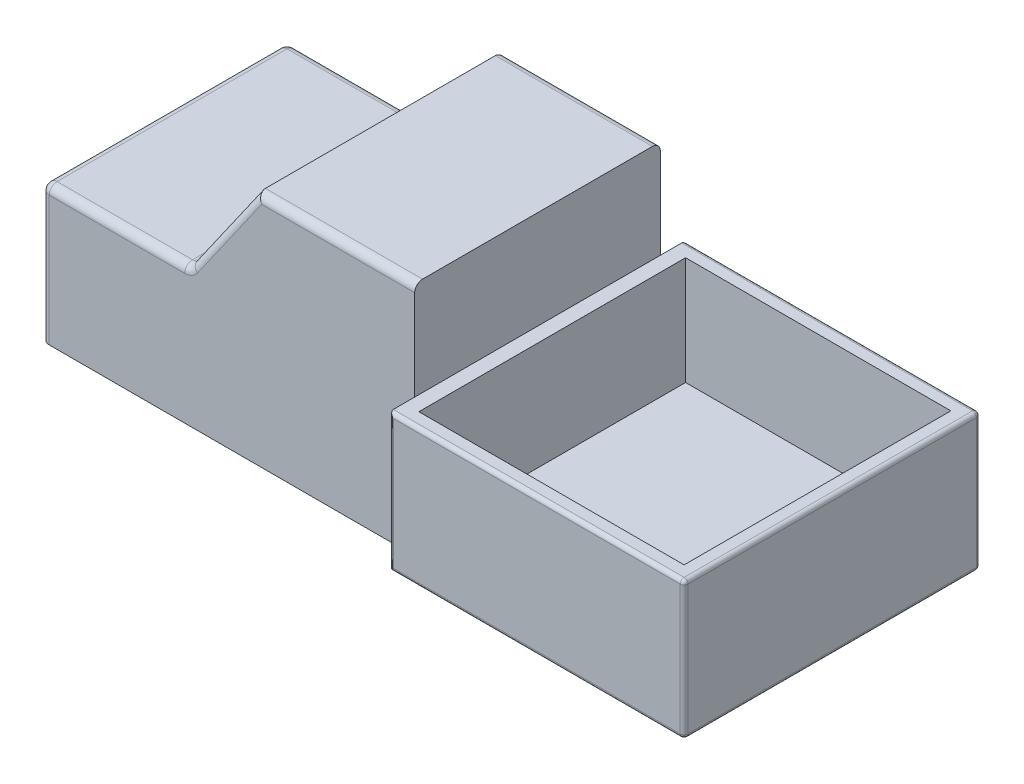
ISO-10303-21;
HEADER;
FILE_DESCRIPTION(('STEP AP214'),'2;1');
FILE_NAME('part.step','',(''),(''),'','','');
FILE_SCHEMA(('AUTOMOTIVE_DESIGN { 1 0 10303 214 1 1 1 1 }'));
ENDSEC;
DATA;
#1=APPLICATION_CONTEXT('core data for automotive mechanical design processes');
#2=APPLICATION_PROTOCOL_DEFINITION('international standard','automotive_design',2000,#1);
#3=PRODUCT_CONTEXT('',#1,'mechanical');
#4=PRODUCT('Part','Part','',(#3));
#5=PRODUCT_RELATED_PRODUCT_CATEGORY('part','',(#4));
#6=PRODUCT_DEFINITION_FORMATION('','',#4);
#7=PRODUCT_DEFINITION_CONTEXT('part definition',#1,'design');
#8=PRODUCT_DEFINITION('design','',#6,#7);
#9=PRODUCT_DEFINITION_SHAPE('','',#8);
#10=(LENGTH_UNIT() NAMED_UNIT(*) SI_UNIT(.MILLI.,.METRE.));
#11=(NAMED_UNIT(*) PLANE_ANGLE_UNIT() SI_UNIT($,.RADIAN.));
#12=(NAMED_UNIT(*) SI_UNIT($,.STERADIAN.) SOLID_ANGLE_UNIT());
#13=UNCERTAINTY_MEASURE_WITH_UNIT(LENGTH_MEASURE(1.E-05),#10,'distance_accuracy_value','');
#14=(GEOMETRIC_REPRESENTATION_CONTEXT(3) GLOBAL_UNCERTAINTY_ASSIGNED_CONTEXT((#13)) GLOBAL_UNIT_ASSIGNED_CONTEXT((#10,
#11,#12)) REPRESENTATION_CONTEXT('',''));
#15=CARTESIAN_POINT('',(0.,0.,0.));
#16=DIRECTION('',(0.,0.,1.));
#17=DIRECTION('',(1.,0.,0.));
#18=AXIS2_PLACEMENT_3D('',#15,#16,#17);
#19=CARTESIAN_POINT('',(-215.9,88.9,158.75));
#20=DIRECTION('',(0.,-1.,0.));
#21=DIRECTION('',(1.,0.,0.));
#22=AXIS2_PLACEMENT_3D('',#19,#20,#21);
#23=PLANE('',#22);
#24=DIRECTION('',(-1.,0.,0.));
#25=VECTOR('',#24,1.);
#26=CARTESIAN_POINT('',(-215.9,88.9,148.59));
#27=LINE('',#26,#25);
#28=CARTESIAN_POINT('',(-396.24,88.9,148.59));
#29=VERTEX_POINT('',#28);
#30=CARTESIAN_POINT('',(-221.188961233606,88.9,148.59));
#31=VERTEX_POINT('',#30);
#32=EDGE_CURVE('E357',#29,#31,#27,.F.);
#33=ORIENTED_EDGE('',*,*,#32,.T.);
#34=DIRECTION('',(0.,0.,-1.));
#35=VECTOR('',#34,1.);
#36=CARTESIAN_POINT('',(-221.188961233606,88.9,-158.75));
#37=LINE('',#36,#35);
#38=CARTESIAN_POINT('',(-221.188961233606,88.9,-148.59));
#39=VERTEX_POINT('',#38);
#40=EDGE_CURVE('E359',#31,#39,#37,.T.);
#41=ORIENTED_EDGE('',*,*,#40,.T.);
#42=DIRECTION('',(-1.,0.,0.));
#43=VECTOR('',#42,1.);
#44=CARTESIAN_POINT('',(-215.9,88.9,-148.59));
#45=LINE('',#44,#43);
#46=CARTESIAN_POINT('',(-396.24,88.9,-148.59));
#47=VERTEX_POINT('',#46);
#48=EDGE_CURVE('E353',#39,#47,#45,.T.);
#49=ORIENTED_EDGE('',*,*,#48,.T.);
#50=DIRECTION('',(0.,0.,-1.));
#51=VECTOR('',#50,1.);
#52=CARTESIAN_POINT('',(-396.24,88.9,158.75));
#53=LINE('',#52,#51);
#54=EDGE_CURVE('E355',#47,#29,#53,.F.);
#55=ORIENTED_EDGE('',*,*,#54,.T.);
#56=EDGE_LOOP('',(#33,#41,#49,#55));
#57=FACE_BOUND('',#56,.T.);
#58=ADVANCED_FACE('F51',(#57),#23,.F.);
#59=CARTESIAN_POINT('',(-406.4,88.9,158.75));
#60=DIRECTION('',(1.,0.,0.));
#61=DIRECTION('',(0.,0.,-1.));
#62=AXIS2_PLACEMENT_3D('',#59,#60,#61);
#63=PLANE('',#62);
#64=DIRECTION('',(0.,0.,-1.));
#65=VECTOR('',#64,1.);
#66=CARTESIAN_POINT('',(-406.4,78.74,158.75));
#67=LINE('',#66,#65);
#68=CARTESIAN_POINT('',(-406.4,78.74,148.59));
#69=VERTEX_POINT('',#68);
#70=CARTESIAN_POINT('',(-406.4,78.74,-148.59));
#71=VERTEX_POINT('',#70);
#72=EDGE_CURVE('E364',#69,#71,#67,.T.);
#73=ORIENTED_EDGE('',*,*,#72,.T.);
#74=DIRECTION('',(0.,-1.,0.));
#75=VECTOR('',#74,1.);
#76=CARTESIAN_POINT('',(-406.4,88.9,-148.59));
#77=LINE('',#76,#75);
#78=CARTESIAN_POINT('',(-406.4,-88.9,-148.59));
#79=VERTEX_POINT('',#78);
#80=EDGE_CURVE('E366',#71,#79,#77,.T.);
#81=ORIENTED_EDGE('',*,*,#80,.T.);
#82=DIRECTION('',(0.,0.,-1.));
#83=VECTOR('',#82,1.);
#84=CARTESIAN_POINT('',(-406.4,-88.9,158.75));
#85=LINE('',#84,#83);
#86=CARTESIAN_POINT('',(-406.4,-88.9,148.59));
#87=VERTEX_POINT('',#86);
#88=EDGE_CURVE('E321',#87,#79,#85,.T.);
#89=ORIENTED_EDGE('',*,*,#88,.F.);
#90=DIRECTION('',(0.,-1.,0.));
#91=VECTOR('',#90,1.);
#92=CARTESIAN_POINT('',(-406.4,88.9,148.59));
#93=LINE('',#92,#91);
#94=EDGE_CURVE('E362',#87,#69,#93,.F.);
#95=ORIENTED_EDGE('',*,*,#94,.T.);
#96=EDGE_LOOP('',(#73,#81,#89,#95));
#97=FACE_BOUND('',#96,.T.);
#98=ADVANCED_FACE('F587',(#97),#63,.F.);
#99=CARTESIAN_POINT('',(-406.4,-88.9,158.75));
#100=DIRECTION('',(0.,1.,0.));
#101=DIRECTION('',(0.,0.,1.));
#102=AXIS2_PLACEMENT_3D('',#99,#100,#101);
#103=PLANE('',#102);
#104=DIRECTION('',(0.,0.,-1.));
#105=VECTOR('',#104,1.);
#106=CARTESIAN_POINT('',(452.12,-88.9,191.45));
#107=LINE('',#106,#105);
#108=CARTESIAN_POINT('',(452.12,-88.9,-186.37));
#109=VERTEX_POINT('',#108);
#110=CARTESIAN_POINT('',(452.12,-88.9,186.37));
#111=VERTEX_POINT('',#110);
#112=EDGE_CURVE('E436',#109,#111,#107,.F.);
#113=ORIENTED_EDGE('',*,*,#112,.T.);
#114=DIRECTION('',(1.,0.,0.));
#115=VECTOR('',#114,1.);
#116=CARTESIAN_POINT('',(-406.4,-88.9,186.37));
#117=LINE('',#116,#115);
#118=CARTESIAN_POINT('',(76.2,-88.9,186.37));
#119=VERTEX_POINT('',#118);
#120=EDGE_CURVE('E438',#111,#119,#117,.F.);
#121=ORIENTED_EDGE('',*,*,#120,.T.);
#122=DIRECTION('',(0.,0.,-1.));
#123=VECTOR('',#122,1.);
#124=CARTESIAN_POINT('',(76.2,-88.9,191.45));
#125=LINE('',#124,#123);
#126=CARTESIAN_POINT('',(76.2,-88.9,158.75));
#127=VERTEX_POINT('',#126);
#128=EDGE_CURVE('E298',#119,#127,#125,.T.);
#129=ORIENTED_EDGE('',*,*,#128,.T.);
#130=DIRECTION('',(1.,0.,0.));
#131=VECTOR('',#130,1.);
#132=CARTESIAN_POINT('',(-406.4,-88.9,158.75));
#133=LINE('',#132,#131);
#134=CARTESIAN_POINT('',(-396.24,-88.9,158.75));
#135=VERTEX_POINT('',#134);
#136=EDGE_CURVE('E301',#135,#127,#133,.T.);
#137=ORIENTED_EDGE('',*,*,#136,.F.);
#138=CARTESIAN_POINT('',(-396.24,-88.9,148.59));
#139=DIRECTION('',(0.,1.,0.));
#140=DIRECTION('',(0.,0.,1.));
#141=AXIS2_PLACEMENT_3D('',#138,#139,#140);
#142=CIRCLE('',#141,10.16);
#143=EDGE_CURVE('E376',#135,#87,#142,.F.);
#144=ORIENTED_EDGE('',*,*,#143,.T.);
#145=ORIENTED_EDGE('',*,*,#88,.T.);
#146=CARTESIAN_POINT('',(-396.24,-88.9,-148.59));
#147=DIRECTION('',(0.,1.,0.));
#148=DIRECTION('',(0.,0.,1.));
#149=AXIS2_PLACEMENT_3D('',#146,#147,#148);
#150=CIRCLE('',#149,10.16);
#151=CARTESIAN_POINT('',(-396.24,-88.9,-158.75));
#152=VERTEX_POINT('',#151);
#153=EDGE_CURVE('E378',#79,#152,#150,.F.);
#154=ORIENTED_EDGE('',*,*,#153,.T.);
#155=DIRECTION('',(1.,0.,0.));
#156=VECTOR('',#155,1.);
#157=CARTESIAN_POINT('',(-406.4,-88.9,-158.75));
#158=LINE('',#157,#156);
#159=CARTESIAN_POINT('',(76.2,-88.9,-158.75));
#160=VERTEX_POINT('',#159);
#161=EDGE_CURVE('E300',#152,#160,#158,.T.);
#162=ORIENTED_EDGE('',*,*,#161,.T.);
#163=DIRECTION('',(0.,0.,1.));
#164=VECTOR('',#163,1.);
#165=CARTESIAN_POINT('',(76.2,-88.9,-191.45));
#166=LINE('',#165,#164);
#167=CARTESIAN_POINT('',(76.2,-88.9,-186.37));
#168=VERTEX_POINT('',#167);
#169=EDGE_CURVE('E288',#168,#160,#166,.T.);
#170=ORIENTED_EDGE('',*,*,#169,.F.);
#171=DIRECTION('',(1.,0.,0.));
#172=VECTOR('',#171,1.);
#173=CARTESIAN_POINT('',(-406.4,-88.9,-186.37));
#174=LINE('',#173,#172);
#175=EDGE_CURVE('E434',#168,#109,#174,.T.);
#176=ORIENTED_EDGE('',*,*,#175,.T.);
#177=EDGE_LOOP('',(#113,#121,#129,#137,#144,#145,#154,#162,#170,#176));
#178=FACE_BOUND('',#177,.T.);
#179=ADVANCED_FACE('F529',(#178),#103,.F.);
#180=CARTESIAN_POINT('',(406.4,88.9,158.75));
#181=DIRECTION('',(0.,-1.,0.));
#182=DIRECTION('',(1.,0.,0.));
#183=AXIS2_PLACEMENT_3D('',#180,#181,#182);
#184=PLANE('',#183);
#185=DIRECTION('',(0.,0.,1.));
#186=VECTOR('',#185,1.);
#187=CARTESIAN_POINT('',(95.2499999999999,88.8999999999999,-172.4));
#188=LINE('',#187,#186);
#189=CARTESIAN_POINT('',(95.2499999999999,88.8999999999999,-172.4));
#190=VERTEX_POINT('',#189);
#191=CARTESIAN_POINT('',(95.25,88.8999999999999,172.4));
#192=VERTEX_POINT('',#191);
#193=EDGE_CURVE('E275',#190,#192,#188,.T.);
#194=ORIENTED_EDGE('',*,*,#193,.F.);
#195=DIRECTION('',(-1.,0.,0.));
#196=VECTOR('',#195,1.);
#197=CARTESIAN_POINT('',(95.2499999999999,88.8999999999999,-172.4));
#198=LINE('',#197,#196);
#199=CARTESIAN_POINT('',(438.15,88.9,-172.4));
#200=VERTEX_POINT('',#199);
#201=EDGE_CURVE('E249',#200,#190,#198,.T.);
#202=ORIENTED_EDGE('',*,*,#201,.F.);
#203=DIRECTION('',(0.,0.,-1.));
#204=VECTOR('',#203,1.);
#205=CARTESIAN_POINT('',(438.15,88.9,-172.4));
#206=LINE('',#205,#204);
#207=CARTESIAN_POINT('',(438.15,88.9,172.4));
#208=VERTEX_POINT('',#207);
#209=EDGE_CURVE('E266',#208,#200,#206,.T.);
#210=ORIENTED_EDGE('',*,*,#209,.F.);
#211=DIRECTION('',(1.,0.,0.));
#212=VECTOR('',#211,1.);
#213=CARTESIAN_POINT('',(95.25,88.8999999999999,172.4));
#214=LINE('',#213,#212);
#215=EDGE_CURVE('E269',#192,#208,#214,.T.);
#216=ORIENTED_EDGE('',*,*,#215,.F.);
#217=EDGE_LOOP('',(#194,#202,#210,#216));
#218=FACE_BOUND('',#217,.T.);
#219=DIRECTION('',(0.,0.,-1.));
#220=VECTOR('',#219,1.);
#221=CARTESIAN_POINT('',(76.1999999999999,88.8999999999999,191.45));
#222=LINE('',#221,#220);
#223=CARTESIAN_POINT('',(76.1999999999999,88.8999999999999,186.37));
#224=VERTEX_POINT('',#223);
#225=CARTESIAN_POINT('',(76.1999999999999,88.8999999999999,158.75));
#226=VERTEX_POINT('',#225);
#227=EDGE_CURVE('E296',#224,#226,#222,.T.);
#228=ORIENTED_EDGE('',*,*,#227,.F.);
#229=DIRECTION('',(-1.,0.,0.));
#230=VECTOR('',#229,1.);
#231=CARTESIAN_POINT('',(406.4,88.9,186.37));
#232=LINE('',#231,#230);
#233=CARTESIAN_POINT('',(452.12,88.9,186.37));
#234=VERTEX_POINT('',#233);
#235=EDGE_CURVE('E431',#224,#234,#232,.F.);
#236=ORIENTED_EDGE('',*,*,#235,.T.);
#237=DIRECTION('',(0.,0.,1.));
#238=VECTOR('',#237,1.);
#239=CARTESIAN_POINT('',(452.12,88.9,-191.45));
#240=LINE('',#239,#238);
#241=CARTESIAN_POINT('',(452.12,88.9,-186.37));
#242=VERTEX_POINT('',#241);
#243=EDGE_CURVE('E429',#234,#242,#240,.F.);
#244=ORIENTED_EDGE('',*,*,#243,.T.);
#245=DIRECTION('',(-1.,0.,0.));
#246=VECTOR('',#245,1.);
#247=CARTESIAN_POINT('',(406.4,88.9,-186.37));
#248=LINE('',#247,#246);
#249=CARTESIAN_POINT('',(76.1999999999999,88.8999999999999,-186.37));
#250=VERTEX_POINT('',#249);
#251=EDGE_CURVE('E427',#242,#250,#248,.T.);
#252=ORIENTED_EDGE('',*,*,#251,.T.);
#253=DIRECTION('',(0.,0.,1.));
#254=VECTOR('',#253,1.);
#255=CARTESIAN_POINT('',(76.1999999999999,88.8999999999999,-191.45));
#256=LINE('',#255,#254);
#257=CARTESIAN_POINT('',(76.1999999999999,88.8999999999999,-158.75));
#258=VERTEX_POINT('',#257);
#259=EDGE_CURVE('E291',#250,#258,#256,.T.);
#260=ORIENTED_EDGE('',*,*,#259,.T.);
#261=DIRECTION('',(0.,0.,-1.));
#262=VECTOR('',#261,1.);
#263=CARTESIAN_POINT('',(76.1999999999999,88.8999999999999,158.75));
#264=LINE('',#263,#262);
#265=EDGE_CURVE('E318',#226,#258,#264,.T.);
#266=ORIENTED_EDGE('',*,*,#265,.F.);
#267=EDGE_LOOP('',(#228,#236,#244,#252,#260,#266));
#268=FACE_BOUND('',#267,.T.);
#269=ADVANCED_FACE('F541',(#218,#268),#184,.F.);
#270=CARTESIAN_POINT('',(76.1999999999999,88.8999999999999,158.75));
#271=DIRECTION('',(-1.,0.,0.));
#272=DIRECTION('',(0.,0.,1.));
#273=AXIS2_PLACEMENT_3D('',#270,#271,#272);
#274=PLANE('',#273);
#275=DIRECTION('',(0.,1.,0.));
#276=VECTOR('',#275,1.);
#277=CARTESIAN_POINT('',(76.1999999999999,88.8999999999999,-158.75));
#278=LINE('',#277,#276);
#279=CARTESIAN_POINT('',(76.1999999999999,205.74,-158.75));
#280=VERTEX_POINT('',#279);
#281=EDGE_CURVE('E305',#258,#280,#278,.T.);
#282=ORIENTED_EDGE('',*,*,#281,.T.);
#283=CARTESIAN_POINT('',(76.1999999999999,205.74,-148.59));
#284=DIRECTION('',(-1.,0.,0.));
#285=DIRECTION('',(0.,0.,1.));
#286=AXIS2_PLACEMENT_3D('',#283,#284,#285);
#287=CIRCLE('',#286,10.16);
#288=CARTESIAN_POINT('',(76.1999999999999,215.9,-148.59));
#289=VERTEX_POINT('',#288);
#290=EDGE_CURVE('E374',#280,#289,#287,.F.);
#291=ORIENTED_EDGE('',*,*,#290,.T.);
#292=DIRECTION('',(0.,0.,-1.));
#293=VECTOR('',#292,1.);
#294=CARTESIAN_POINT('',(76.1999999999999,215.9,158.75));
#295=LINE('',#294,#293);
#296=CARTESIAN_POINT('',(76.1999999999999,215.9,148.59));
#297=VERTEX_POINT('',#296);
#298=EDGE_CURVE('E315',#297,#289,#295,.T.);
#299=ORIENTED_EDGE('',*,*,#298,.F.);
#300=CARTESIAN_POINT('',(76.1999999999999,205.74,148.59));
#301=DIRECTION('',(-1.,0.,0.));
#302=DIRECTION('',(0.,0.,1.));
#303=AXIS2_PLACEMENT_3D('',#300,#301,#302);
#304=CIRCLE('',#303,10.16);
#305=CARTESIAN_POINT('',(76.1999999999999,205.74,158.75));
#306=VERTEX_POINT('',#305);
#307=EDGE_CURVE('E372',#297,#306,#304,.F.);
#308=ORIENTED_EDGE('',*,*,#307,.T.);
#309=DIRECTION('',(0.,1.,0.));
#310=VECTOR('',#309,1.);
#311=CARTESIAN_POINT('',(76.1999999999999,88.8999999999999,158.75));
#312=LINE('',#311,#310);
#313=EDGE_CURVE('E304',#226,#306,#312,.T.);
#314=ORIENTED_EDGE('',*,*,#313,.F.);
#315=ORIENTED_EDGE('',*,*,#265,.T.);
#316=EDGE_LOOP('',(#282,#291,#299,#308,#314,#315));
#317=FACE_BOUND('',#316,.T.);
#318=ADVANCED_FACE('F958',(#317),#274,.F.);
#319=CARTESIAN_POINT('',(76.1999999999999,215.9,158.75));
#320=DIRECTION('',(0.,-1.,0.));
#321=DIRECTION('',(1.,0.,0.));
#322=AXIS2_PLACEMENT_3D('',#319,#320,#321);
#323=PLANE('',#322);
#324=ORIENTED_EDGE('',*,*,#298,.T.);
#325=DIRECTION('',(-1.,0.,0.));
#326=VECTOR('',#325,1.);
#327=CARTESIAN_POINT('',(76.1999999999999,215.9,-148.59));
#328=LINE('',#327,#326);
#329=CARTESIAN_POINT('',(-126.973642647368,215.9,-148.59));
#330=VERTEX_POINT('',#329);
#331=EDGE_CURVE('E370',#289,#330,#328,.T.);
#332=ORIENTED_EDGE('',*,*,#331,.T.);
#333=DIRECTION('',(0.,0.,-1.));
#334=VECTOR('',#333,1.);
#335=CARTESIAN_POINT('',(-126.973642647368,215.9,158.75));
#336=LINE('',#335,#334);
#337=CARTESIAN_POINT('',(-126.973642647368,215.9,148.59));
#338=VERTEX_POINT('',#337);
#339=EDGE_CURVE('E308',#338,#330,#336,.T.);
#340=ORIENTED_EDGE('',*,*,#339,.F.);
#341=DIRECTION('',(-1.,0.,0.));
#342=VECTOR('',#341,1.);
#343=CARTESIAN_POINT('',(76.1999999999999,215.9,148.59));
#344=LINE('',#343,#342);
#345=EDGE_CURVE('E368',#338,#297,#344,.F.);
#346=ORIENTED_EDGE('',*,*,#345,.T.);
#347=EDGE_LOOP('',(#324,#332,#340,#346));
#348=FACE_BOUND('',#347,.T.);
#349=ADVANCED_FACE('F949',(#348),#323,.F.);
#350=CARTESIAN_POINT('',(-126.973642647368,215.9,158.75));
#351=DIRECTION('',(0.819152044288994,-0.573576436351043,0.));
#352=DIRECTION('',(0.573576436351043,0.819152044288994,0.));
#353=AXIS2_PLACEMENT_3D('',#350,#351,#352);
#354=PLANE('',#353);
#355=DIRECTION('',(0.,0.,-1.));
#356=VECTOR('',#355,1.);
#357=CARTESIAN_POINT('',(-212.86637646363,93.2324634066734,158.75));
#358=LINE('',#357,#356);
#359=CARTESIAN_POINT('',(-212.86637646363,93.2324634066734,-148.59));
#360=VERTEX_POINT('',#359);
#361=CARTESIAN_POINT('',(-212.86637646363,93.2324634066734,148.59));
#362=VERTEX_POINT('',#361);
#363=EDGE_CURVE('E336',#360,#362,#358,.F.);
#364=ORIENTED_EDGE('',*,*,#363,.T.);
#365=DIRECTION('',(-0.573576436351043,-0.819152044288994,0.));
#366=VECTOR('',#365,1.);
#367=CARTESIAN_POINT('',(-126.973642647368,215.9,148.59));
#368=LINE('',#367,#366);
#369=EDGE_CURVE('E340',#362,#338,#368,.F.);
#370=ORIENTED_EDGE('',*,*,#369,.T.);
#371=ORIENTED_EDGE('',*,*,#339,.T.);
#372=DIRECTION('',(-0.573576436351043,-0.819152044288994,0.));
#373=VECTOR('',#372,1.);
#374=CARTESIAN_POINT('',(-126.973642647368,215.9,-148.59));
#375=LINE('',#374,#373);
#376=EDGE_CURVE('E338',#330,#360,#375,.T.);
#377=ORIENTED_EDGE('',*,*,#376,.T.);
#378=EDGE_LOOP('',(#364,#370,#371,#377));
#379=FACE_BOUND('',#378,.T.);
#380=ADVANCED_FACE('F939',(#379),#354,.F.);
#381=CARTESIAN_POINT('',(0.,0.,158.75));
#382=DIRECTION('',(0.,0.,1.));
#383=DIRECTION('',(1.,0.,0.));
#384=AXIS2_PLACEMENT_3D('',#381,#382,#383);
#385=PLANE('',#384);
#386=ORIENTED_EDGE('',*,*,#313,.T.);
#387=DIRECTION('',(-1.,0.,0.));
#388=VECTOR('',#387,1.);
#389=CARTESIAN_POINT('',(-126.973642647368,205.74,158.75));
#390=LINE('',#389,#388);
#391=CARTESIAN_POINT('',(-121.684681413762,205.74,158.75));
#392=VERTEX_POINT('',#391);
#393=EDGE_CURVE('E334',#306,#392,#390,.T.);
#394=ORIENTED_EDGE('',*,*,#393,.T.);
#395=DIRECTION('',(-0.573576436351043,-0.819152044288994,0.));
#396=VECTOR('',#395,1.);
#397=CARTESIAN_POINT('',(-207.577415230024,83.0724634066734,158.75));
#398=LINE('',#397,#396);
#399=CARTESIAN_POINT('',(-204.543791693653,87.4049268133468,158.75));
#400=VERTEX_POINT('',#399);
#401=EDGE_CURVE('E331',#392,#400,#398,.T.);
#402=ORIENTED_EDGE('',*,*,#401,.T.);
#403=CARTESIAN_POINT('',(-221.188961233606,99.06,158.75));
#404=DIRECTION('',(0.,0.,1.));
#405=DIRECTION('',(1.,0.,0.));
#406=AXIS2_PLACEMENT_3D('',#403,#404,#405);
#407=CIRCLE('',#406,20.32);
#408=CARTESIAN_POINT('',(-221.188961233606,78.74,158.75));
#409=VERTEX_POINT('',#408);
#410=EDGE_CURVE('E328',#409,#400,#407,.T.);
#411=ORIENTED_EDGE('',*,*,#410,.F.);
#412=DIRECTION('',(-1.,0.,0.));
#413=VECTOR('',#412,1.);
#414=CARTESIAN_POINT('',(-406.4,78.74,158.75));
#415=LINE('',#414,#413);
#416=CARTESIAN_POINT('',(-396.24,78.74,158.75));
#417=VERTEX_POINT('',#416);
#418=EDGE_CURVE('E326',#409,#417,#415,.T.);
#419=ORIENTED_EDGE('',*,*,#418,.T.);
#420=DIRECTION('',(0.,-1.,0.));
#421=VECTOR('',#420,1.);
#422=CARTESIAN_POINT('',(-396.24,-88.9,158.75));
#423=LINE('',#422,#421);
#424=EDGE_CURVE('E324',#417,#135,#423,.T.);
#425=ORIENTED_EDGE('',*,*,#424,.T.);
#426=ORIENTED_EDGE('',*,*,#136,.T.);
#427=DIRECTION('',(0.,-1.,0.));
#428=VECTOR('',#427,1.);
#429=CARTESIAN_POINT('',(76.2,-88.9,158.75));
#430=LINE('',#429,#428);
#431=EDGE_CURVE('E293',#226,#127,#430,.T.);
#432=ORIENTED_EDGE('',*,*,#431,.F.);
#433=EDGE_LOOP('',(#386,#394,#402,#411,#419,#425,#426,#432));
#434=FACE_BOUND('',#433,.T.);
#435=ADVANCED_FACE('F929',(#434),#385,.T.);
#436=CARTESIAN_POINT('',(0.,0.,-158.75));
#437=DIRECTION('',(0.,0.,1.));
#438=DIRECTION('',(1.,0.,0.));
#439=AXIS2_PLACEMENT_3D('',#436,#437,#438);
#440=PLANE('',#439);
#441=DIRECTION('',(-0.573576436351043,-0.819152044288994,0.));
#442=VECTOR('',#441,1.);
#443=CARTESIAN_POINT('',(-178.317826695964,124.859486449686,-158.75));
#444=LINE('',#443,#442);
#445=CARTESIAN_POINT('',(-204.543791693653,87.4049268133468,-158.75));
#446=VERTEX_POINT('',#445);
#447=CARTESIAN_POINT('',(-121.684681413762,205.74,-158.75));
#448=VERTEX_POINT('',#447);
#449=EDGE_CURVE('E349',#446,#448,#444,.F.);
#450=ORIENTED_EDGE('',*,*,#449,.T.);
#451=DIRECTION('',(-1.,0.,0.));
#452=VECTOR('',#451,1.);
#453=CARTESIAN_POINT('',(0.,205.74,-158.75));
#454=LINE('',#453,#452);
#455=EDGE_CURVE('E351',#448,#280,#454,.F.);
#456=ORIENTED_EDGE('',*,*,#455,.T.);
#457=ORIENTED_EDGE('',*,*,#281,.F.);
#458=DIRECTION('',(0.,-1.,0.));
#459=VECTOR('',#458,1.);
#460=CARTESIAN_POINT('',(76.2,-88.9,-158.75));
#461=LINE('',#460,#459);
#462=EDGE_CURVE('E285',#258,#160,#461,.T.);
#463=ORIENTED_EDGE('',*,*,#462,.T.);
#464=ORIENTED_EDGE('',*,*,#161,.F.);
#465=DIRECTION('',(0.,-1.,0.));
#466=VECTOR('',#465,1.);
#467=CARTESIAN_POINT('',(-396.24,0.,-158.75));
#468=LINE('',#467,#466);
#469=CARTESIAN_POINT('',(-396.24,78.74,-158.75));
#470=VERTEX_POINT('',#469);
#471=EDGE_CURVE('E342',#152,#470,#468,.F.);
#472=ORIENTED_EDGE('',*,*,#471,.T.);
#473=DIRECTION('',(-1.,0.,0.));
#474=VECTOR('',#473,1.);
#475=CARTESIAN_POINT('',(0.,78.7400000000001,-158.75));
#476=LINE('',#475,#474);
#477=CARTESIAN_POINT('',(-221.188961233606,78.74,-158.75));
#478=VERTEX_POINT('',#477);
#479=EDGE_CURVE('E344',#470,#478,#476,.F.);
#480=ORIENTED_EDGE('',*,*,#479,.T.);
#481=CARTESIAN_POINT('',(-221.188961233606,99.06,-158.75));
#482=DIRECTION('',(0.,0.,1.));
#483=DIRECTION('',(1.,0.,0.));
#484=AXIS2_PLACEMENT_3D('',#481,#482,#483);
#485=CIRCLE('',#484,20.32);
#486=EDGE_CURVE('E346',#446,#478,#485,.F.);
#487=ORIENTED_EDGE('',*,*,#486,.F.);
#488=EDGE_LOOP('',(#450,#456,#457,#463,#464,#472,#480,#487));
#489=FACE_BOUND('',#488,.T.);
#490=ADVANCED_FACE('F920',(#489),#440,.F.);
#491=CARTESIAN_POINT('',(76.2,-88.9,191.45));
#492=DIRECTION('',(1.,0.,0.));
#493=DIRECTION('',(0.,1.,0.));
#494=AXIS2_PLACEMENT_3D('',#491,#492,#493);
#495=PLANE('',#494);
#496=ORIENTED_EDGE('',*,*,#128,.F.);
#497=DIRECTION('',(0.,-1.,0.));
#498=VECTOR('',#497,1.);
#499=CARTESIAN_POINT('',(76.2,-88.9,186.37));
#500=LINE('',#499,#498);
#501=EDGE_CURVE('E440',#119,#224,#500,.F.);
#502=ORIENTED_EDGE('',*,*,#501,.T.);
#503=ORIENTED_EDGE('',*,*,#227,.T.);
#504=ORIENTED_EDGE('',*,*,#431,.T.);
#505=EDGE_LOOP('',(#496,#502,#503,#504));
#506=FACE_BOUND('',#505,.T.);
#507=ADVANCED_FACE('F572',(#506),#495,.F.);
#508=CARTESIAN_POINT('',(0.,0.,191.45));
#509=DIRECTION('',(0.,0.,-1.));
#510=DIRECTION('',(-1.,0.,0.));
#511=AXIS2_PLACEMENT_3D('',#508,#509,#510);
#512=PLANE('',#511);
#513=DIRECTION('',(-1.,0.,0.));
#514=VECTOR('',#513,1.);
#515=CARTESIAN_POINT('',(0.,83.8199999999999,191.45));
#516=LINE('',#515,#514);
#517=CARTESIAN_POINT('',(452.12,83.82,191.45));
#518=VERTEX_POINT('',#517);
#519=CARTESIAN_POINT('',(81.2799999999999,83.82,191.45));
#520=VERTEX_POINT('',#519);
#521=EDGE_CURVE('E422',#518,#520,#516,.T.);
#522=ORIENTED_EDGE('',*,*,#521,.T.);
#523=DIRECTION('',(0.,-1.,0.));
#524=VECTOR('',#523,1.);
#525=CARTESIAN_POINT('',(81.2799999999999,0.,191.45));
#526=LINE('',#525,#524);
#527=CARTESIAN_POINT('',(81.28,-83.82,191.45));
#528=VERTEX_POINT('',#527);
#529=EDGE_CURVE('E425',#520,#528,#526,.T.);
#530=ORIENTED_EDGE('',*,*,#529,.T.);
#531=DIRECTION('',(1.,0.,0.));
#532=VECTOR('',#531,1.);
#533=CARTESIAN_POINT('',(0.,-83.82,191.45));
#534=LINE('',#533,#532);
#535=CARTESIAN_POINT('',(452.12,-83.82,191.45));
#536=VERTEX_POINT('',#535);
#537=EDGE_CURVE('E420',#528,#536,#534,.T.);
#538=ORIENTED_EDGE('',*,*,#537,.T.);
#539=DIRECTION('',(0.,-1.,0.));
#540=VECTOR('',#539,1.);
#541=CARTESIAN_POINT('',(452.12,88.9,191.45));
#542=LINE('',#541,#540);
#543=EDGE_CURVE('E380',#536,#518,#542,.F.);
#544=ORIENTED_EDGE('',*,*,#543,.T.);
#545=EDGE_LOOP('',(#522,#530,#538,#544));
#546=FACE_BOUND('',#545,.T.);
#547=ADVANCED_FACE('F560',(#546),#512,.F.);
#548=CARTESIAN_POINT('',(76.2,-88.9,-191.45));
#549=DIRECTION('',(-1.,0.,0.));
#550=DIRECTION('',(0.,-1.,0.));
#551=AXIS2_PLACEMENT_3D('',#548,#549,#550);
#552=PLANE('',#551);
#553=ORIENTED_EDGE('',*,*,#259,.F.);
#554=DIRECTION('',(0.,-1.,0.));
#555=VECTOR('',#554,1.);
#556=CARTESIAN_POINT('',(76.2,-88.9,-186.37));
#557=LINE('',#556,#555);
#558=EDGE_CURVE('E11',#250,#168,#557,.T.);
#559=ORIENTED_EDGE('',*,*,#558,.T.);
#560=ORIENTED_EDGE('',*,*,#169,.T.);
#561=ORIENTED_EDGE('',*,*,#462,.F.);
#562=EDGE_LOOP('',(#553,#559,#560,#561));
#563=FACE_BOUND('',#562,.T.);
#564=ADVANCED_FACE('F537',(#563),#552,.T.);
#565=CARTESIAN_POINT('',(0.,0.,-191.45));
#566=DIRECTION('',(0.,0.,1.));
#567=DIRECTION('',(-1.,0.,0.));
#568=AXIS2_PLACEMENT_3D('',#565,#566,#567);
#569=PLANE('',#568);
#570=DIRECTION('',(0.,1.,0.));
#571=VECTOR('',#570,1.);
#572=CARTESIAN_POINT('',(452.12,-88.9,-191.45));
#573=LINE('',#572,#571);
#574=CARTESIAN_POINT('',(452.12,83.82,-191.45));
#575=VERTEX_POINT('',#574);
#576=CARTESIAN_POINT('',(452.12,-83.82,-191.45));
#577=VERTEX_POINT('',#576);
#578=EDGE_CURVE('E68',#575,#577,#573,.F.);
#579=ORIENTED_EDGE('',*,*,#578,.T.);
#580=DIRECTION('',(1.,0.,0.));
#581=VECTOR('',#580,1.);
#582=CARTESIAN_POINT('',(0.,-83.82,-191.45));
#583=LINE('',#582,#581);
#584=CARTESIAN_POINT('',(81.28,-83.82,-191.45));
#585=VERTEX_POINT('',#584);
#586=EDGE_CURVE('E60',#577,#585,#583,.F.);
#587=ORIENTED_EDGE('',*,*,#586,.T.);
#588=DIRECTION('',(0.,-1.,0.));
#589=VECTOR('',#588,1.);
#590=CARTESIAN_POINT('',(81.2799999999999,88.9,-191.45));
#591=LINE('',#590,#589);
#592=CARTESIAN_POINT('',(81.2799999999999,83.82,-191.45));
#593=VERTEX_POINT('',#592);
#594=EDGE_CURVE('E451',#585,#593,#591,.F.);
#595=ORIENTED_EDGE('',*,*,#594,.T.);
#596=DIRECTION('',(-1.,0.,0.));
#597=VECTOR('',#596,1.);
#598=CARTESIAN_POINT('',(0.,83.8199999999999,-191.45));
#599=LINE('',#598,#597);
#600=EDGE_CURVE('E73',#593,#575,#599,.F.);
#601=ORIENTED_EDGE('',*,*,#600,.T.);
#602=EDGE_LOOP('',(#579,#587,#595,#601));
#603=FACE_BOUND('',#602,.T.);
#604=ADVANCED_FACE('F508',(#603),#569,.F.);
#605=CARTESIAN_POINT('',(-396.24,88.9,-148.59));
#606=DIRECTION('',(0.,-1.,0.));
#607=DIRECTION('',(0.,0.,-1.));
#608=AXIS2_PLACEMENT_3D('',#605,#606,#607);
#609=CYLINDRICAL_SURFACE('',#608,10.16);
#610=CARTESIAN_POINT('',(-396.24,78.74,-148.59));
#611=DIRECTION('',(0.,1.,0.));
#612=DIRECTION('',(0.,0.,1.));
#613=AXIS2_PLACEMENT_3D('',#610,#611,#612);
#614=CIRCLE('',#613,10.16);
#615=EDGE_CURVE('E289',#470,#71,#614,.T.);
#616=ORIENTED_EDGE('',*,*,#615,.F.);
#617=ORIENTED_EDGE('',*,*,#471,.F.);
#618=ORIENTED_EDGE('',*,*,#153,.F.);
#619=ORIENTED_EDGE('',*,*,#80,.F.);
#620=EDGE_LOOP('',(#616,#617,#618,#619));
#621=FACE_BOUND('',#620,.T.);
#622=ADVANCED_FACE('F648',(#621),#609,.T.);
#623=CARTESIAN_POINT('',(-396.24,78.74,-148.59));
#624=DIRECTION('',(-1.,0.,0.));
#625=DIRECTION('',(0.,0.,1.));
#626=AXIS2_PLACEMENT_3D('',#623,#624,#625);
#627=SPHERICAL_SURFACE('',#626,10.16);
#628=CARTESIAN_POINT('',(-396.24,78.74,-148.59));
#629=DIRECTION('',(-1.,0.,0.));
#630=DIRECTION('',(0.,0.,1.));
#631=AXIS2_PLACEMENT_3D('',#628,#629,#630);
#632=CIRCLE('',#631,10.16);
#633=EDGE_CURVE('E411',#470,#47,#632,.F.);
#634=ORIENTED_EDGE('',*,*,#633,.F.);
#635=ORIENTED_EDGE('',*,*,#615,.T.);
#636=CARTESIAN_POINT('',(-396.24,78.74,-148.59));
#637=DIRECTION('',(0.,0.,-1.));
#638=DIRECTION('',(-1.,0.,0.));
#639=AXIS2_PLACEMENT_3D('',#636,#637,#638);
#640=CIRCLE('',#639,10.16);
#641=EDGE_CURVE('E414',#47,#71,#640,.F.);
#642=ORIENTED_EDGE('',*,*,#641,.F.);
#643=EDGE_LOOP('',(#634,#635,#642));
#644=FACE_BOUND('',#643,.T.);
#645=ADVANCED_FACE('F644',(#644),#627,.T.);
#646=CARTESIAN_POINT('',(76.1999999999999,205.74,-148.59));
#647=DIRECTION('',(-1.,0.,0.));
#648=DIRECTION('',(0.,-1.,0.));
#649=AXIS2_PLACEMENT_3D('',#646,#647,#648);
#650=CYLINDRICAL_SURFACE('',#649,10.16);
#651=ORIENTED_EDGE('',*,*,#290,.F.);
#652=ORIENTED_EDGE('',*,*,#455,.F.);
#653=CARTESIAN_POINT('',(-121.684681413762,205.74,-148.59));
#654=DIRECTION('',(-0.887010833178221,-0.461748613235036,0.));
#655=DIRECTION('',(-0.461748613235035,0.887010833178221,0.));
#656=AXIS2_PLACEMENT_3D('',#653,#654,#655);
#657=ELLIPSE('',#656,11.454200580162,10.16);
#658=EDGE_CURVE('E408',#330,#448,#657,.T.);
#659=ORIENTED_EDGE('',*,*,#658,.F.);
#660=ORIENTED_EDGE('',*,*,#331,.F.);
#661=EDGE_LOOP('',(#651,#652,#659,#660));
#662=FACE_BOUND('',#661,.T.);
#663=ADVANCED_FACE('F640',(#662),#650,.T.);
#664=CARTESIAN_POINT('',(-396.24,0.,148.59));
#665=DIRECTION('',(0.,1.,0.));
#666=DIRECTION('',(0.,0.,1.));
#667=AXIS2_PLACEMENT_3D('',#664,#665,#666);
#668=CYLINDRICAL_SURFACE('',#667,10.16);
#669=ORIENTED_EDGE('',*,*,#143,.F.);
#670=ORIENTED_EDGE('',*,*,#424,.F.);
#671=CARTESIAN_POINT('',(-396.24,78.74,148.59));
#672=DIRECTION('',(0.,1.,0.));
#673=DIRECTION('',(0.,0.,1.));
#674=AXIS2_PLACEMENT_3D('',#671,#672,#673);
#675=CIRCLE('',#674,10.16);
#676=EDGE_CURVE('E405',#69,#417,#675,.T.);
#677=ORIENTED_EDGE('',*,*,#676,.F.);
#678=ORIENTED_EDGE('',*,*,#94,.F.);
#679=EDGE_LOOP('',(#669,#670,#677,#678));
#680=FACE_BOUND('',#679,.T.);
#681=ADVANCED_FACE('F636',(#680),#668,.T.);
#682=CARTESIAN_POINT('',(-396.24,78.74,158.75));
#683=DIRECTION('',(0.,0.,-1.));
#684=DIRECTION('',(-1.,0.,0.));
#685=AXIS2_PLACEMENT_3D('',#682,#683,#684);
#686=CYLINDRICAL_SURFACE('',#685,10.16);
#687=ORIENTED_EDGE('',*,*,#641,.T.);
#688=ORIENTED_EDGE('',*,*,#72,.F.);
#689=CARTESIAN_POINT('',(-396.24,78.74,148.59));
#690=DIRECTION('',(0.,0.,1.));
#691=DIRECTION('',(1.,0.,0.));
#692=AXIS2_PLACEMENT_3D('',#689,#690,#691);
#693=CIRCLE('',#692,10.16);
#694=EDGE_CURVE('E402',#29,#69,#693,.T.);
#695=ORIENTED_EDGE('',*,*,#694,.F.);
#696=ORIENTED_EDGE('',*,*,#54,.F.);
#697=EDGE_LOOP('',(#687,#688,#695,#696));
#698=FACE_BOUND('',#697,.T.);
#699=ADVANCED_FACE('F632',(#698),#686,.T.);
#700=CARTESIAN_POINT('',(-215.9,78.74,-148.59));
#701=DIRECTION('',(-1.,0.,0.));
#702=DIRECTION('',(0.,-1.,0.));
#703=AXIS2_PLACEMENT_3D('',#700,#701,#702);
#704=CYLINDRICAL_SURFACE('',#703,10.16);
#705=ORIENTED_EDGE('',*,*,#633,.T.);
#706=ORIENTED_EDGE('',*,*,#48,.F.);
#707=CARTESIAN_POINT('',(-221.188961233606,78.74,-148.59));
#708=DIRECTION('',(1.,0.,0.));
#709=DIRECTION('',(0.,0.,-1.));
#710=AXIS2_PLACEMENT_3D('',#707,#708,#709);
#711=CIRCLE('',#710,10.16);
#712=EDGE_CURVE('E399',#478,#39,#711,.T.);
#713=ORIENTED_EDGE('',*,*,#712,.F.);
#714=ORIENTED_EDGE('',*,*,#479,.F.);
#715=EDGE_LOOP('',(#705,#706,#713,#714));
#716=FACE_BOUND('',#715,.T.);
#717=ADVANCED_FACE('F628',(#716),#704,.T.);
#718=CARTESIAN_POINT('',(-118.651057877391,210.072463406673,-148.59));
#719=DIRECTION('',(-0.573576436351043,-0.819152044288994,0.));
#720=DIRECTION('',(0.819152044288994,-0.573576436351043,0.));
#721=AXIS2_PLACEMENT_3D('',#718,#719,#720);
#722=CYLINDRICAL_SURFACE('',#721,10.16);
#723=ORIENTED_EDGE('',*,*,#658,.T.);
#724=ORIENTED_EDGE('',*,*,#449,.F.);
#725=CARTESIAN_POINT('',(-204.543791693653,87.4049268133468,-148.59));
#726=DIRECTION('',(-0.573576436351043,-0.819152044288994,0.));
#727=DIRECTION('',(0.819152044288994,-0.573576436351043,0.));
#728=AXIS2_PLACEMENT_3D('',#725,#726,#727);
#729=CIRCLE('',#728,10.16);
#730=EDGE_CURVE('E396',#360,#446,#729,.T.);
#731=ORIENTED_EDGE('',*,*,#730,.F.);
#732=ORIENTED_EDGE('',*,*,#376,.F.);
#733=EDGE_LOOP('',(#723,#724,#731,#732));
#734=FACE_BOUND('',#733,.T.);
#735=ADVANCED_FACE('F624',(#734),#722,.T.);
#736=CARTESIAN_POINT('',(-396.24,78.74,148.59));
#737=DIRECTION('',(-1.,0.,0.));
#738=DIRECTION('',(0.,0.,1.));
#739=AXIS2_PLACEMENT_3D('',#736,#737,#738);
#740=SPHERICAL_SURFACE('',#739,10.16);
#741=ORIENTED_EDGE('',*,*,#694,.T.);
#742=ORIENTED_EDGE('',*,*,#676,.T.);
#743=CARTESIAN_POINT('',(-396.24,78.74,148.59));
#744=DIRECTION('',(-1.,0.,0.));
#745=DIRECTION('',(0.,0.,1.));
#746=AXIS2_PLACEMENT_3D('',#743,#744,#745);
#747=CIRCLE('',#746,10.16);
#748=EDGE_CURVE('E393',#29,#417,#747,.F.);
#749=ORIENTED_EDGE('',*,*,#748,.F.);
#750=EDGE_LOOP('',(#741,#742,#749));
#751=FACE_BOUND('',#750,.T.);
#752=ADVANCED_FACE('F620',(#751),#740,.T.);
#753=CARTESIAN_POINT('',(-221.188961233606,99.06,-148.59));
#754=DIRECTION('',(0.,0.,1.));
#755=DIRECTION('',(1.,0.,0.));
#756=AXIS2_PLACEMENT_3D('',#753,#754,#755);
#757=TOROIDAL_SURFACE('',#756,20.32,10.16);
#758=ORIENTED_EDGE('',*,*,#486,.T.);
#759=ORIENTED_EDGE('',*,*,#712,.T.);
#760=CARTESIAN_POINT('',(-221.188961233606,99.06,-148.59));
#761=DIRECTION('',(0.,0.,1.));
#762=DIRECTION('',(1.,0.,0.));
#763=AXIS2_PLACEMENT_3D('',#760,#761,#762);
#764=CIRCLE('',#763,10.16);
#765=EDGE_CURVE('E391',#360,#39,#764,.F.);
#766=ORIENTED_EDGE('',*,*,#765,.F.);
#767=ORIENTED_EDGE('',*,*,#730,.T.);
#768=EDGE_LOOP('',(#758,#759,#766,#767));
#769=FACE_BOUND('',#768,.T.);
#770=ADVANCED_FACE('F616',(#769),#757,.T.);
#771=CARTESIAN_POINT('',(0.,78.7400000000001,148.59));
#772=DIRECTION('',(1.,0.,0.));
#773=DIRECTION('',(0.,1.,0.));
#774=AXIS2_PLACEMENT_3D('',#771,#772,#773);
#775=CYLINDRICAL_SURFACE('',#774,10.16);
#776=ORIENTED_EDGE('',*,*,#748,.T.);
#777=ORIENTED_EDGE('',*,*,#418,.F.);
#778=CARTESIAN_POINT('',(-221.188961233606,78.74,148.59));
#779=DIRECTION('',(1.,0.,0.));
#780=DIRECTION('',(0.,0.,-1.));
#781=AXIS2_PLACEMENT_3D('',#778,#779,#780);
#782=CIRCLE('',#781,10.16);
#783=EDGE_CURVE('E388',#31,#409,#782,.T.);
#784=ORIENTED_EDGE('',*,*,#783,.F.);
#785=ORIENTED_EDGE('',*,*,#32,.F.);
#786=EDGE_LOOP('',(#776,#777,#784,#785));
#787=FACE_BOUND('',#786,.T.);
#788=ADVANCED_FACE('F612',(#787),#775,.T.);
#789=CARTESIAN_POINT('',(-221.188961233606,99.06,158.75));
#790=DIRECTION('',(0.,0.,1.));
#791=DIRECTION('',(1.,0.,0.));
#792=AXIS2_PLACEMENT_3D('',#789,#790,#791);
#793=CYLINDRICAL_SURFACE('',#792,10.16);
#794=ORIENTED_EDGE('',*,*,#765,.T.);
#795=ORIENTED_EDGE('',*,*,#40,.F.);
#796=CARTESIAN_POINT('',(-221.188961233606,99.06,148.59));
#797=DIRECTION('',(0.,0.,1.));
#798=DIRECTION('',(1.,0.,0.));
#799=AXIS2_PLACEMENT_3D('',#796,#797,#798);
#800=CIRCLE('',#799,10.16);
#801=EDGE_CURVE('E385',#362,#31,#800,.F.);
#802=ORIENTED_EDGE('',*,*,#801,.F.);
#803=ORIENTED_EDGE('',*,*,#363,.F.);
#804=EDGE_LOOP('',(#794,#795,#802,#803));
#805=FACE_BOUND('',#804,.T.);
#806=ADVANCED_FACE('F608',(#805),#793,.F.);
#807=CARTESIAN_POINT('',(0.,205.74,148.59));
#808=DIRECTION('',(1.,0.,0.));
#809=DIRECTION('',(0.,1.,0.));
#810=AXIS2_PLACEMENT_3D('',#807,#808,#809);
#811=CYLINDRICAL_SURFACE('',#810,10.16);
#812=ORIENTED_EDGE('',*,*,#307,.F.);
#813=ORIENTED_EDGE('',*,*,#345,.F.);
#814=CARTESIAN_POINT('',(-121.684681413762,205.74,148.59));
#815=DIRECTION('',(0.887010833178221,0.461748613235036,0.));
#816=DIRECTION('',(0.461748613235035,-0.887010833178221,0.));
#817=AXIS2_PLACEMENT_3D('',#814,#815,#816);
#818=ELLIPSE('',#817,11.454200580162,10.16);
#819=EDGE_CURVE('E382',#392,#338,#818,.F.);
#820=ORIENTED_EDGE('',*,*,#819,.F.);
#821=ORIENTED_EDGE('',*,*,#393,.F.);
#822=EDGE_LOOP('',(#812,#813,#820,#821));
#823=FACE_BOUND('',#822,.T.);
#824=ADVANCED_FACE('F604',(#823),#811,.T.);
#825=CARTESIAN_POINT('',(-221.188961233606,99.06,148.59));
#826=DIRECTION('',(0.,0.,1.));
#827=DIRECTION('',(1.,0.,0.));
#828=AXIS2_PLACEMENT_3D('',#825,#826,#827);
#829=TOROIDAL_SURFACE('',#828,20.32,10.16);
#830=ORIENTED_EDGE('',*,*,#783,.T.);
#831=ORIENTED_EDGE('',*,*,#410,.T.);
#832=CARTESIAN_POINT('',(-204.543791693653,87.4049268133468,148.59));
#833=DIRECTION('',(-0.573576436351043,-0.819152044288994,0.));
#834=DIRECTION('',(0.819152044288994,-0.573576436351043,0.));
#835=AXIS2_PLACEMENT_3D('',#832,#833,#834);
#836=CIRCLE('',#835,10.16);
#837=EDGE_CURVE('E281',#362,#400,#836,.F.);
#838=ORIENTED_EDGE('',*,*,#837,.F.);
#839=ORIENTED_EDGE('',*,*,#801,.T.);
#840=EDGE_LOOP('',(#830,#831,#838,#839));
#841=FACE_BOUND('',#840,.T.);
#842=ADVANCED_FACE('F600',(#841),#829,.T.);
#843=CARTESIAN_POINT('',(-178.317826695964,124.859486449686,148.59));
#844=DIRECTION('',(0.573576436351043,0.819152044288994,0.));
#845=DIRECTION('',(-0.819152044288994,0.573576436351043,0.));
#846=AXIS2_PLACEMENT_3D('',#843,#844,#845);
#847=CYLINDRICAL_SURFACE('',#846,10.16);
#848=ORIENTED_EDGE('',*,*,#819,.T.);
#849=ORIENTED_EDGE('',*,*,#369,.F.);
#850=ORIENTED_EDGE('',*,*,#837,.T.);
#851=ORIENTED_EDGE('',*,*,#401,.F.);
#852=EDGE_LOOP('',(#848,#849,#850,#851));
#853=FACE_BOUND('',#852,.T.);
#854=ADVANCED_FACE('F597',(#853),#847,.T.);
#855=CARTESIAN_POINT('',(457.2,0.,0.));
#856=DIRECTION('',(1.,0.,0.));
#857=DIRECTION('',(0.,0.,-1.));
#858=AXIS2_PLACEMENT_3D('',#855,#856,#857);
#859=PLANE('',#858);
#860=DIRECTION('',(0.,0.,1.));
#861=VECTOR('',#860,1.);
#862=CARTESIAN_POINT('',(457.2,83.82,191.45));
#863=LINE('',#862,#861);
#864=CARTESIAN_POINT('',(457.2,83.82,-186.37));
#865=VERTEX_POINT('',#864);
#866=CARTESIAN_POINT('',(457.2,83.82,186.37));
#867=VERTEX_POINT('',#866);
#868=EDGE_CURVE('E446',#865,#867,#863,.T.);
#869=ORIENTED_EDGE('',*,*,#868,.T.);
#870=DIRECTION('',(0.,-1.,0.));
#871=VECTOR('',#870,1.);
#872=CARTESIAN_POINT('',(457.2,-88.9,186.37));
#873=LINE('',#872,#871);
#874=CARTESIAN_POINT('',(457.2,-83.82,186.37));
#875=VERTEX_POINT('',#874);
#876=EDGE_CURVE('E449',#867,#875,#873,.T.);
#877=ORIENTED_EDGE('',*,*,#876,.T.);
#878=DIRECTION('',(0.,0.,-1.));
#879=VECTOR('',#878,1.);
#880=CARTESIAN_POINT('',(457.2,-83.82,-191.45));
#881=LINE('',#880,#879);
#882=CARTESIAN_POINT('',(457.2,-83.82,-186.37));
#883=VERTEX_POINT('',#882);
#884=EDGE_CURVE('E444',#875,#883,#881,.T.);
#885=ORIENTED_EDGE('',*,*,#884,.T.);
#886=DIRECTION('',(0.,1.,0.));
#887=VECTOR('',#886,1.);
#888=CARTESIAN_POINT('',(457.2,88.9,-186.37));
#889=LINE('',#888,#887);
#890=EDGE_CURVE('E442',#883,#865,#889,.T.);
#891=ORIENTED_EDGE('',*,*,#890,.T.);
#892=EDGE_LOOP('',(#869,#877,#885,#891));
#893=FACE_BOUND('',#892,.T.);
#894=ADVANCED_FACE('F550',(#893),#859,.T.);
#895=CARTESIAN_POINT('',(95.2499999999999,-50.8,-172.4));
#896=DIRECTION('',(0.,0.,-1.));
#897=DIRECTION('',(-1.,0.,0.));
#898=AXIS2_PLACEMENT_3D('',#895,#896,#897);
#899=PLANE('',#898);
#900=ORIENTED_EDGE('',*,*,#201,.T.);
#901=DIRECTION('',(0.,1.,0.));
#902=VECTOR('',#901,1.);
#903=CARTESIAN_POINT('',(95.2499999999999,-50.8,-172.4));
#904=LINE('',#903,#902);
#905=CARTESIAN_POINT('',(95.2499999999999,-50.8,-172.4));
#906=VERTEX_POINT('',#905);
#907=EDGE_CURVE('E242',#906,#190,#904,.T.);
#908=ORIENTED_EDGE('',*,*,#907,.F.);
#909=DIRECTION('',(-1.,0.,0.));
#910=VECTOR('',#909,1.);
#911=CARTESIAN_POINT('',(95.2499999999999,-50.8,-172.4));
#912=LINE('',#911,#910);
#913=CARTESIAN_POINT('',(438.15,-50.8,-172.4));
#914=VERTEX_POINT('',#913);
#915=EDGE_CURVE('E246',#914,#906,#912,.T.);
#916=ORIENTED_EDGE('',*,*,#915,.F.);
#917=DIRECTION('',(0.,1.,0.));
#918=VECTOR('',#917,1.);
#919=CARTESIAN_POINT('',(438.15,-50.8,-172.4));
#920=LINE('',#919,#918);
#921=EDGE_CURVE('E279',#914,#200,#920,.T.);
#922=ORIENTED_EDGE('',*,*,#921,.T.);
#923=EDGE_LOOP('',(#900,#908,#916,#922));
#924=FACE_BOUND('',#923,.T.);
#925=ADVANCED_FACE('F244',(#924),#899,.F.);
#926=CARTESIAN_POINT('',(438.15,-50.8,-172.4));
#927=DIRECTION('',(1.,0.,0.));
#928=DIRECTION('',(0.,0.,-1.));
#929=AXIS2_PLACEMENT_3D('',#926,#927,#928);
#930=PLANE('',#929);
#931=ORIENTED_EDGE('',*,*,#209,.T.);
#932=ORIENTED_EDGE('',*,*,#921,.F.);
#933=DIRECTION('',(0.,0.,-1.));
#934=VECTOR('',#933,1.);
#935=CARTESIAN_POINT('',(438.15,-50.8,-172.4));
#936=LINE('',#935,#934);
#937=CARTESIAN_POINT('',(438.15,-50.8,172.4));
#938=VERTEX_POINT('',#937);
#939=EDGE_CURVE('E254',#938,#914,#936,.T.);
#940=ORIENTED_EDGE('',*,*,#939,.F.);
#941=DIRECTION('',(0.,1.,0.));
#942=VECTOR('',#941,1.);
#943=CARTESIAN_POINT('',(438.15,-50.8,172.4));
#944=LINE('',#943,#942);
#945=EDGE_CURVE('E282',#938,#208,#944,.T.);
#946=ORIENTED_EDGE('',*,*,#945,.T.);
#947=EDGE_LOOP('',(#931,#932,#940,#946));
#948=FACE_BOUND('',#947,.T.);
#949=ADVANCED_FACE('F776',(#948),#930,.F.);
#950=CARTESIAN_POINT('',(95.25,-50.8,172.4));
#951=DIRECTION('',(0.,0.,1.));
#952=DIRECTION('',(1.,0.,0.));
#953=AXIS2_PLACEMENT_3D('',#950,#951,#952);
#954=PLANE('',#953);
#955=ORIENTED_EDGE('',*,*,#215,.T.);
#956=ORIENTED_EDGE('',*,*,#945,.F.);
#957=DIRECTION('',(1.,0.,0.));
#958=VECTOR('',#957,1.);
#959=CARTESIAN_POINT('',(95.25,-50.8,172.4));
#960=LINE('',#959,#958);
#961=CARTESIAN_POINT('',(95.25,-50.8,172.4));
#962=VERTEX_POINT('',#961);
#963=EDGE_CURVE('E262',#962,#938,#960,.T.);
#964=ORIENTED_EDGE('',*,*,#963,.F.);
#965=DIRECTION('',(0.,1.,0.));
#966=VECTOR('',#965,1.);
#967=CARTESIAN_POINT('',(95.25,-50.8,172.4));
#968=LINE('',#967,#966);
#969=EDGE_CURVE('E253',#962,#192,#968,.T.);
#970=ORIENTED_EDGE('',*,*,#969,.T.);
#971=EDGE_LOOP('',(#955,#956,#964,#970));
#972=FACE_BOUND('',#971,.T.);
#973=ADVANCED_FACE('F767',(#972),#954,.F.);
#974=CARTESIAN_POINT('',(95.2499999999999,-50.8,-172.4));
#975=DIRECTION('',(-1.,0.,0.));
#976=DIRECTION('',(0.,0.,1.));
#977=AXIS2_PLACEMENT_3D('',#974,#975,#976);
#978=PLANE('',#977);
#979=ORIENTED_EDGE('',*,*,#193,.T.);
#980=ORIENTED_EDGE('',*,*,#969,.F.);
#981=DIRECTION('',(0.,0.,1.));
#982=VECTOR('',#981,1.);
#983=CARTESIAN_POINT('',(95.2499999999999,-50.8,-172.4));
#984=LINE('',#983,#982);
#985=EDGE_CURVE('E257',#906,#962,#984,.T.);
#986=ORIENTED_EDGE('',*,*,#985,.F.);
#987=ORIENTED_EDGE('',*,*,#907,.T.);
#988=EDGE_LOOP('',(#979,#980,#986,#987));
#989=FACE_BOUND('',#988,.T.);
#990=ADVANCED_FACE('F258',(#989),#978,.F.);
#991=CARTESIAN_POINT('',(0.,-50.8000000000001,0.));
#992=DIRECTION('',(0.,-1.,0.));
#993=DIRECTION('',(1.,0.,0.));
#994=AXIS2_PLACEMENT_3D('',#991,#992,#993);
#995=PLANE('',#994);
#996=ORIENTED_EDGE('',*,*,#915,.T.);
#997=ORIENTED_EDGE('',*,*,#985,.T.);
#998=ORIENTED_EDGE('',*,*,#963,.T.);
#999=ORIENTED_EDGE('',*,*,#939,.T.);
#1000=EDGE_LOOP('',(#996,#997,#998,#999));
#1001=FACE_BOUND('',#1000,.T.);
#1002=ADVANCED_FACE('F264',(#1001),#995,.F.);
#1003=CARTESIAN_POINT('',(-406.4,-83.82,-186.37));
#1004=DIRECTION('',(1.,0.,0.));
#1005=DIRECTION('',(0.,0.,-1.));
#1006=AXIS2_PLACEMENT_3D('',#1003,#1004,#1005);
#1007=CYLINDRICAL_SURFACE('',#1006,5.08);
#1008=CARTESIAN_POINT('',(452.12,-83.82,-186.37));
#1009=DIRECTION('',(1.,0.,0.));
#1010=DIRECTION('',(0.,0.,-1.));
#1011=AXIS2_PLACEMENT_3D('',#1008,#1009,#1010);
#1012=CIRCLE('',#1011,5.08);
#1013=EDGE_CURVE('E494',#109,#577,#1012,.T.);
#1014=ORIENTED_EDGE('',*,*,#1013,.F.);
#1015=ORIENTED_EDGE('',*,*,#175,.F.);
#1016=CARTESIAN_POINT('',(81.28,-83.82,-186.37));
#1017=DIRECTION('',(-0.707106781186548,0.707106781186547,0.));
#1018=DIRECTION('',(0.707106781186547,0.707106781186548,0.));
#1019=AXIS2_PLACEMENT_3D('',#1016,#1017,#1018);
#1020=ELLIPSE('',#1019,7.18420489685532,5.08);
#1021=EDGE_CURVE('E55',#585,#168,#1020,.T.);
#1022=ORIENTED_EDGE('',*,*,#1021,.F.);
#1023=ORIENTED_EDGE('',*,*,#586,.F.);
#1024=EDGE_LOOP('',(#1014,#1015,#1022,#1023));
#1025=FACE_BOUND('',#1024,.T.);
#1026=ADVANCED_FACE('F53',(#1025),#1007,.T.);
#1027=CARTESIAN_POINT('',(81.28,-88.9,-186.37));
#1028=DIRECTION('',(0.,1.,0.));
#1029=DIRECTION('',(-1.,0.,0.));
#1030=AXIS2_PLACEMENT_3D('',#1027,#1028,#1029);
#1031=CYLINDRICAL_SURFACE('',#1030,5.08);
#1032=ORIENTED_EDGE('',*,*,#1021,.T.);
#1033=ORIENTED_EDGE('',*,*,#558,.F.);
#1034=CARTESIAN_POINT('',(81.2799999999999,83.82,-186.37));
#1035=DIRECTION('',(0.707106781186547,0.707106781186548,0.));
#1036=DIRECTION('',(-0.707106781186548,0.707106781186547,0.));
#1037=AXIS2_PLACEMENT_3D('',#1034,#1035,#1036);
#1038=ELLIPSE('',#1037,7.18420489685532,5.08);
#1039=EDGE_CURVE('E492',#593,#250,#1038,.T.);
#1040=ORIENTED_EDGE('',*,*,#1039,.F.);
#1041=ORIENTED_EDGE('',*,*,#594,.F.);
#1042=EDGE_LOOP('',(#1032,#1033,#1040,#1041));
#1043=FACE_BOUND('',#1042,.T.);
#1044=ADVANCED_FACE('F504',(#1043),#1031,.T.);
#1045=CARTESIAN_POINT('',(452.12,-83.82,-186.37));
#1046=DIRECTION('',(0.,0.,-1.));
#1047=DIRECTION('',(-1.,0.,0.));
#1048=AXIS2_PLACEMENT_3D('',#1045,#1046,#1047);
#1049=SPHERICAL_SURFACE('',#1048,5.08);
#1050=CARTESIAN_POINT('',(452.12,-83.82,-186.37));
#1051=DIRECTION('',(0.,0.,-1.));
#1052=DIRECTION('',(0.,1.,0.));
#1053=AXIS2_PLACEMENT_3D('',#1050,#1051,#1052);
#1054=CIRCLE('',#1053,5.08);
#1055=EDGE_CURVE('E486',#109,#883,#1054,.F.);
#1056=ORIENTED_EDGE('',*,*,#1055,.F.);
#1057=ORIENTED_EDGE('',*,*,#1013,.T.);
#1058=CARTESIAN_POINT('',(452.12,-83.82,-186.37));
#1059=DIRECTION('',(0.,-1.,0.));
#1060=DIRECTION('',(0.,0.,-1.));
#1061=AXIS2_PLACEMENT_3D('',#1058,#1059,#1060);
#1062=CIRCLE('',#1061,5.08);
#1063=EDGE_CURVE('E489',#883,#577,#1062,.F.);
#1064=ORIENTED_EDGE('',*,*,#1063,.F.);
#1065=EDGE_LOOP('',(#1056,#1057,#1064));
#1066=FACE_BOUND('',#1065,.T.);
#1067=ADVANCED_FACE('F521',(#1066),#1049,.T.);
#1068=CARTESIAN_POINT('',(406.4,83.82,-186.37));
#1069=DIRECTION('',(-1.,0.,0.));
#1070=DIRECTION('',(0.,-1.,0.));
#1071=AXIS2_PLACEMENT_3D('',#1068,#1069,#1070);
#1072=CYLINDRICAL_SURFACE('',#1071,5.08);
#1073=ORIENTED_EDGE('',*,*,#1039,.T.);
#1074=ORIENTED_EDGE('',*,*,#251,.F.);
#1075=CARTESIAN_POINT('',(452.12,83.82,-186.37));
#1076=DIRECTION('',(1.,0.,0.));
#1077=DIRECTION('',(0.,0.,-1.));
#1078=AXIS2_PLACEMENT_3D('',#1075,#1076,#1077);
#1079=CIRCLE('',#1078,5.08);
#1080=EDGE_CURVE('E483',#575,#242,#1079,.T.);
#1081=ORIENTED_EDGE('',*,*,#1080,.F.);
#1082=ORIENTED_EDGE('',*,*,#600,.F.);
#1083=EDGE_LOOP('',(#1073,#1074,#1081,#1082));
#1084=FACE_BOUND('',#1083,.T.);
#1085=ADVANCED_FACE('F512',(#1084),#1072,.T.);
#1086=CARTESIAN_POINT('',(452.12,0.,-186.37));
#1087=DIRECTION('',(0.,-1.,0.));
#1088=DIRECTION('',(0.,0.,-1.));
#1089=AXIS2_PLACEMENT_3D('',#1086,#1087,#1088);
#1090=CYLINDRICAL_SURFACE('',#1089,5.08);
#1091=ORIENTED_EDGE('',*,*,#1063,.T.);
#1092=ORIENTED_EDGE('',*,*,#578,.F.);
#1093=CARTESIAN_POINT('',(452.12,83.82,-186.37));
#1094=DIRECTION('',(0.,1.,0.));
#1095=DIRECTION('',(0.,0.,1.));
#1096=AXIS2_PLACEMENT_3D('',#1093,#1094,#1095);
#1097=CIRCLE('',#1096,5.08);
#1098=EDGE_CURVE('E480',#865,#575,#1097,.T.);
#1099=ORIENTED_EDGE('',*,*,#1098,.F.);
#1100=ORIENTED_EDGE('',*,*,#890,.F.);
#1101=EDGE_LOOP('',(#1091,#1092,#1099,#1100));
#1102=FACE_BOUND('',#1101,.T.);
#1103=ADVANCED_FACE('F520',(#1102),#1090,.T.);
#1104=CARTESIAN_POINT('',(452.12,-83.82,0.));
#1105=DIRECTION('',(0.,0.,1.));
#1106=DIRECTION('',(1.,0.,0.));
#1107=AXIS2_PLACEMENT_3D('',#1104,#1105,#1106);
#1108=CYLINDRICAL_SURFACE('',#1107,5.08);
#1109=ORIENTED_EDGE('',*,*,#1055,.T.);
#1110=ORIENTED_EDGE('',*,*,#884,.F.);
#1111=CARTESIAN_POINT('',(452.12,-83.82,186.37));
#1112=DIRECTION('',(0.,0.,1.));
#1113=DIRECTION('',(1.,0.,0.));
#1114=AXIS2_PLACEMENT_3D('',#1111,#1112,#1113);
#1115=CIRCLE('',#1114,5.08);
#1116=EDGE_CURVE('E477',#111,#875,#1115,.T.);
#1117=ORIENTED_EDGE('',*,*,#1116,.F.);
#1118=ORIENTED_EDGE('',*,*,#112,.F.);
#1119=EDGE_LOOP('',(#1109,#1110,#1117,#1118));
#1120=FACE_BOUND('',#1119,.T.);
#1121=ADVANCED_FACE('F526',(#1120),#1108,.T.);
#1122=CARTESIAN_POINT('',(452.12,83.82,-186.37));
#1123=DIRECTION('',(0.,0.,-1.));
#1124=DIRECTION('',(-1.,0.,0.));
#1125=AXIS2_PLACEMENT_3D('',#1122,#1123,#1124);
#1126=SPHERICAL_SURFACE('',#1125,5.08);
#1127=ORIENTED_EDGE('',*,*,#1098,.T.);
#1128=ORIENTED_EDGE('',*,*,#1080,.T.);
#1129=CARTESIAN_POINT('',(452.12,83.82,-186.37));
#1130=DIRECTION('',(0.,0.,-1.));
#1131=DIRECTION('',(-1.,0.,0.));
#1132=AXIS2_PLACEMENT_3D('',#1129,#1130,#1131);
#1133=CIRCLE('',#1132,5.08);
#1134=EDGE_CURVE('E474',#865,#242,#1133,.F.);
#1135=ORIENTED_EDGE('',*,*,#1134,.F.);
#1136=EDGE_LOOP('',(#1127,#1128,#1135));
#1137=FACE_BOUND('',#1136,.T.);
#1138=ADVANCED_FACE('F516',(#1137),#1126,.T.);
#1139=CARTESIAN_POINT('',(452.12,-83.82,186.37));
#1140=DIRECTION('',(1.,0.,0.));
#1141=DIRECTION('',(0.,0.,-1.));
#1142=AXIS2_PLACEMENT_3D('',#1139,#1140,#1141);
#1143=SPHERICAL_SURFACE('',#1142,5.08);
#1144=CARTESIAN_POINT('',(452.12,-83.82,186.37));
#1145=DIRECTION('',(1.,0.,0.));
#1146=DIRECTION('',(0.,0.,-1.));
#1147=AXIS2_PLACEMENT_3D('',#1144,#1145,#1146);
#1148=CIRCLE('',#1147,5.08);
#1149=EDGE_CURVE('E468',#111,#536,#1148,.F.);
#1150=ORIENTED_EDGE('',*,*,#1149,.F.);
#1151=ORIENTED_EDGE('',*,*,#1116,.T.);
#1152=CARTESIAN_POINT('',(452.12,-83.82,186.37));
#1153=DIRECTION('',(0.,-1.,0.));
#1154=DIRECTION('',(0.,0.,-1.));
#1155=AXIS2_PLACEMENT_3D('',#1152,#1153,#1154);
#1156=CIRCLE('',#1155,5.08);
#1157=EDGE_CURVE('E471',#536,#875,#1156,.F.);
#1158=ORIENTED_EDGE('',*,*,#1157,.F.);
#1159=EDGE_LOOP('',(#1150,#1151,#1158));
#1160=FACE_BOUND('',#1159,.T.);
#1161=ADVANCED_FACE('F553',(#1160),#1143,.T.);
#1162=CARTESIAN_POINT('',(452.12,83.82,0.));
#1163=DIRECTION('',(0.,0.,-1.));
#1164=DIRECTION('',(-1.,0.,0.));
#1165=AXIS2_PLACEMENT_3D('',#1162,#1163,#1164);
#1166=CYLINDRICAL_SURFACE('',#1165,5.08);
#1167=ORIENTED_EDGE('',*,*,#1134,.T.);
#1168=ORIENTED_EDGE('',*,*,#243,.F.);
#1169=CARTESIAN_POINT('',(452.12,83.82,186.37));
#1170=DIRECTION('',(0.,0.,1.));
#1171=DIRECTION('',(1.,0.,0.));
#1172=AXIS2_PLACEMENT_3D('',#1169,#1170,#1171);
#1173=CIRCLE('',#1172,5.08);
#1174=EDGE_CURVE('E465',#867,#234,#1173,.T.);
#1175=ORIENTED_EDGE('',*,*,#1174,.F.);
#1176=ORIENTED_EDGE('',*,*,#868,.F.);
#1177=EDGE_LOOP('',(#1167,#1168,#1175,#1176));
#1178=FACE_BOUND('',#1177,.T.);
#1179=ADVANCED_FACE('F547',(#1178),#1166,.T.);
#1180=CARTESIAN_POINT('',(452.12,0.,186.37));
#1181=DIRECTION('',(0.,1.,0.));
#1182=DIRECTION('',(0.,0.,1.));
#1183=AXIS2_PLACEMENT_3D('',#1180,#1181,#1182);
#1184=CYLINDRICAL_SURFACE('',#1183,5.08);
#1185=ORIENTED_EDGE('',*,*,#1157,.T.);
#1186=ORIENTED_EDGE('',*,*,#876,.F.);
#1187=CARTESIAN_POINT('',(452.12,83.82,186.37));
#1188=DIRECTION('',(0.,1.,0.));
#1189=DIRECTION('',(0.,0.,1.));
#1190=AXIS2_PLACEMENT_3D('',#1187,#1188,#1189);
#1191=CIRCLE('',#1190,5.08);
#1192=EDGE_CURVE('E463',#518,#867,#1191,.T.);
#1193=ORIENTED_EDGE('',*,*,#1192,.F.);
#1194=ORIENTED_EDGE('',*,*,#543,.F.);
#1195=EDGE_LOOP('',(#1185,#1186,#1193,#1194));
#1196=FACE_BOUND('',#1195,.T.);
#1197=ADVANCED_FACE('F556',(#1196),#1184,.T.);
#1198=CARTESIAN_POINT('',(0.,-83.82,186.37));
#1199=DIRECTION('',(1.,0.,0.));
#1200=DIRECTION('',(0.,0.,-1.));
#1201=AXIS2_PLACEMENT_3D('',#1198,#1199,#1200);
#1202=CYLINDRICAL_SURFACE('',#1201,5.08);
#1203=ORIENTED_EDGE('',*,*,#1149,.T.);
#1204=ORIENTED_EDGE('',*,*,#537,.F.);
#1205=CARTESIAN_POINT('',(81.28,-83.82,186.37));
#1206=DIRECTION('',(0.707106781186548,-0.707106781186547,0.));
#1207=DIRECTION('',(-0.707106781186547,-0.707106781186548,0.));
#1208=AXIS2_PLACEMENT_3D('',#1205,#1206,#1207);
#1209=ELLIPSE('',#1208,7.18420489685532,5.08);
#1210=EDGE_CURVE('E460',#119,#528,#1209,.F.);
#1211=ORIENTED_EDGE('',*,*,#1210,.F.);
#1212=ORIENTED_EDGE('',*,*,#120,.F.);
#1213=EDGE_LOOP('',(#1203,#1204,#1211,#1212));
#1214=FACE_BOUND('',#1213,.T.);
#1215=ADVANCED_FACE('F566',(#1214),#1202,.T.);
#1216=CARTESIAN_POINT('',(452.12,83.82,186.37));
#1217=DIRECTION('',(1.,0.,0.));
#1218=DIRECTION('',(0.,0.,-1.));
#1219=AXIS2_PLACEMENT_3D('',#1216,#1217,#1218);
#1220=SPHERICAL_SURFACE('',#1219,5.08);
#1221=ORIENTED_EDGE('',*,*,#1192,.T.);
#1222=ORIENTED_EDGE('',*,*,#1174,.T.);
#1223=CARTESIAN_POINT('',(452.12,83.82,186.37));
#1224=DIRECTION('',(1.,0.,0.));
#1225=DIRECTION('',(0.,0.,-1.));
#1226=AXIS2_PLACEMENT_3D('',#1223,#1224,#1225);
#1227=CIRCLE('',#1226,5.08);
#1228=EDGE_CURVE('E458',#518,#234,#1227,.F.);
#1229=ORIENTED_EDGE('',*,*,#1228,.F.);
#1230=EDGE_LOOP('',(#1221,#1222,#1229));
#1231=FACE_BOUND('',#1230,.T.);
#1232=ADVANCED_FACE('F577',(#1231),#1220,.T.);
#1233=CARTESIAN_POINT('',(81.2799999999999,0.,186.37));
#1234=DIRECTION('',(0.,-1.,0.));
#1235=DIRECTION('',(1.,0.,0.));
#1236=AXIS2_PLACEMENT_3D('',#1233,#1234,#1235);
#1237=CYLINDRICAL_SURFACE('',#1236,5.08);
#1238=ORIENTED_EDGE('',*,*,#1210,.T.);
#1239=ORIENTED_EDGE('',*,*,#529,.F.);
#1240=CARTESIAN_POINT('',(81.2799999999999,83.82,186.37));
#1241=DIRECTION('',(-0.707106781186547,-0.707106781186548,0.));
#1242=DIRECTION('',(0.707106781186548,-0.707106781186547,0.));
#1243=AXIS2_PLACEMENT_3D('',#1240,#1241,#1242);
#1244=ELLIPSE('',#1243,7.18420489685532,5.08);
#1245=EDGE_CURVE('E456',#224,#520,#1244,.F.);
#1246=ORIENTED_EDGE('',*,*,#1245,.F.);
#1247=ORIENTED_EDGE('',*,*,#501,.F.);
#1248=EDGE_LOOP('',(#1238,#1239,#1246,#1247));
#1249=FACE_BOUND('',#1248,.T.);
#1250=ADVANCED_FACE('F570',(#1249),#1237,.T.);
#1251=CARTESIAN_POINT('',(0.,83.8199999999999,186.37));
#1252=DIRECTION('',(-1.,0.,0.));
#1253=DIRECTION('',(0.,-1.,0.));
#1254=AXIS2_PLACEMENT_3D('',#1251,#1252,#1253);
#1255=CYLINDRICAL_SURFACE('',#1254,5.08);
#1256=ORIENTED_EDGE('',*,*,#1228,.T.);
#1257=ORIENTED_EDGE('',*,*,#235,.F.);
#1258=ORIENTED_EDGE('',*,*,#1245,.T.);
#1259=ORIENTED_EDGE('',*,*,#521,.F.);
#1260=EDGE_LOOP('',(#1256,#1257,#1258,#1259));
#1261=FACE_BOUND('',#1260,.T.);
#1262=ADVANCED_FACE('F575',(#1261),#1255,.T.);
#1263=CLOSED_SHELL('',(#58,#98,#179,#269,#318,#349,#380,#435,#490,#507,#547,#564,#604,#622,#645,
#663,#681,#699,#717,#735,#752,#770,#788,#806,#824,#842,#854,#894,#925,#949,#973,#990,#1002,
#1026,#1044,#1067,#1085,#1103,#1121,#1138,#1161,#1179,#1197,#1215,#1232,#1250,#1262));
#1264=MANIFOLD_SOLID_BREP('B2',#1263);
#1265=ADVANCED_BREP_SHAPE_REPRESENTATION('',(#18,#1264),#14);
#1266=SHAPE_DEFINITION_REPRESENTATION(#9,#1265);
ENDSEC;
END-ISO-10303-21;
